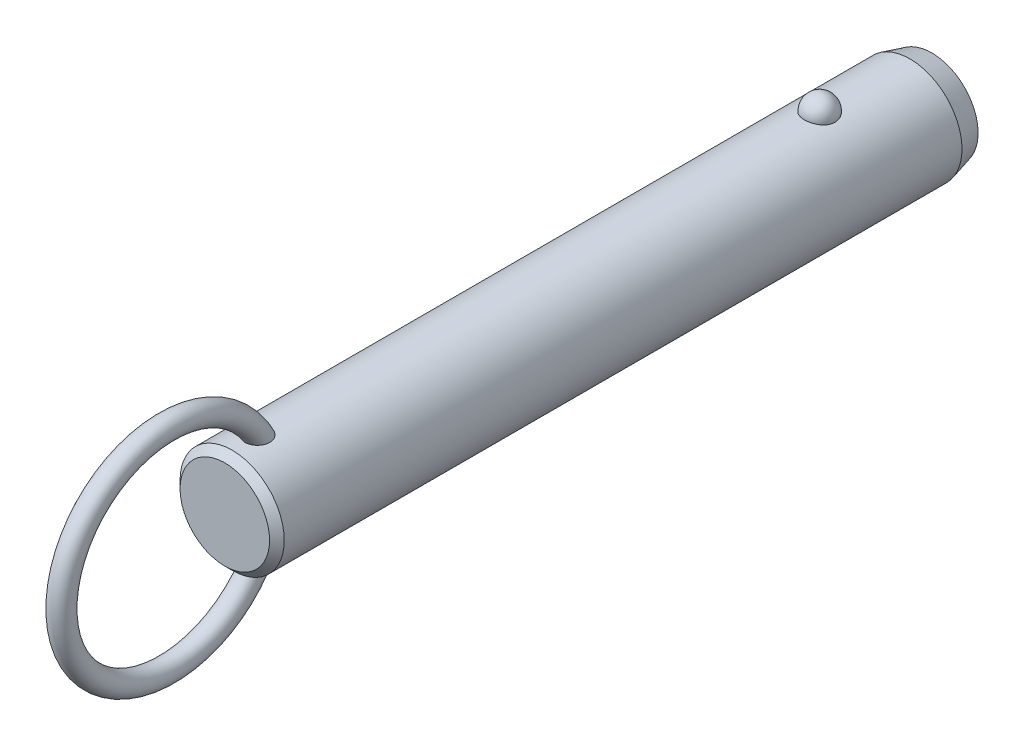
ISO-10303-21;
HEADER;
FILE_DESCRIPTION(('STEP AP214'),'2;1');
FILE_NAME('part.step','',(''),(''),'','','');
FILE_SCHEMA(('AUTOMOTIVE_DESIGN { 1 0 10303 214 1 1 1 1 }'));
ENDSEC;
DATA;
#1=APPLICATION_CONTEXT('core data for automotive mechanical design processes');
#2=APPLICATION_PROTOCOL_DEFINITION('international standard','automotive_design',2000,#1);
#3=PRODUCT_CONTEXT('',#1,'mechanical');
#4=PRODUCT('Part','Part','',(#3));
#5=PRODUCT_RELATED_PRODUCT_CATEGORY('part','',(#4));
#6=PRODUCT_DEFINITION_FORMATION('','',#4);
#7=PRODUCT_DEFINITION_CONTEXT('part definition',#1,'design');
#8=PRODUCT_DEFINITION('design','',#6,#7);
#9=PRODUCT_DEFINITION_SHAPE('','',#8);
#10=(LENGTH_UNIT() NAMED_UNIT(*) SI_UNIT(.MILLI.,.METRE.));
#11=(NAMED_UNIT(*) PLANE_ANGLE_UNIT() SI_UNIT($,.RADIAN.));
#12=(NAMED_UNIT(*) SI_UNIT($,.STERADIAN.) SOLID_ANGLE_UNIT());
#13=UNCERTAINTY_MEASURE_WITH_UNIT(LENGTH_MEASURE(1.E-05),#10,'distance_accuracy_value','');
#14=(GEOMETRIC_REPRESENTATION_CONTEXT(3) GLOBAL_UNCERTAINTY_ASSIGNED_CONTEXT((#13)) GLOBAL_UNIT_ASSIGNED_CONTEXT((#10,
#11,#12)) REPRESENTATION_CONTEXT('',''));
#15=CARTESIAN_POINT('',(0.,0.,0.));
#16=DIRECTION('',(0.,0.,1.));
#17=DIRECTION('',(1.,0.,0.));
#18=AXIS2_PLACEMENT_3D('',#15,#16,#17);
#19=CARTESIAN_POINT('',(0.,0.,71.1));
#20=DIRECTION('',(0.,0.,-1.));
#21=DIRECTION('',(-1.,0.,0.));
#22=AXIS2_PLACEMENT_3D('',#19,#20,#21);
#23=CYLINDRICAL_SURFACE('',#22,7.1);
#24=CARTESIAN_POINT('',(2.0769088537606,6.78943661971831,-2.1));
#25=CARTESIAN_POINT('',(2.07690739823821,6.78943796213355,-1.98268154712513));
#26=CARTESIAN_POINT('',(2.06738130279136,6.79237331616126,-1.86534506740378));
#27=CARTESIAN_POINT('',(2.0295040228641,6.8037853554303,-1.63400788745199));
#28=CARTESIAN_POINT('',(2.00114757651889,6.81226358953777,-1.52000812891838));
#29=CARTESIAN_POINT('',(1.92632025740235,6.83379798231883,-1.29863433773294));
#30=CARTESIAN_POINT('',(1.87985726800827,6.84685214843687,-1.19125744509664));
#31=CARTESIAN_POINT('',(1.76995205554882,6.87608091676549,-0.98604657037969));
#32=CARTESIAN_POINT('',(1.70650980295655,6.8922555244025,-0.88821260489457));
#33=CARTESIAN_POINT('',(1.5638119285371,6.92602930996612,-0.704242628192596));
#34=CARTESIAN_POINT('',(1.4844714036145,6.94363582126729,-0.618173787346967));
#35=CARTESIAN_POINT('',(1.31221746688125,6.97823658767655,-0.460740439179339));
#36=CARTESIAN_POINT('',(1.21930409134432,6.99523084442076,-0.389375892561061));
#37=CARTESIAN_POINT('',(1.02268781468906,7.02666176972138,-0.263547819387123));
#38=CARTESIAN_POINT('',(0.91902009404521,7.04110638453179,-0.209031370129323));
#39=CARTESIAN_POINT('',(0.703548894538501,7.06588726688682,-0.118163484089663));
#40=CARTESIAN_POINT('',(0.591746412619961,7.07622403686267,-0.0818098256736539));
#41=CARTESIAN_POINT('',(0.365557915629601,7.09147068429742,-0.0288711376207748));
#42=CARTESIAN_POINT('',(0.251267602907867,7.09648447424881,-0.0119070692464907));
#43=CARTESIAN_POINT('',(0.0213499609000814,7.10089837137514,0.00304925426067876));
#44=CARTESIAN_POINT('',(-0.0942772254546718,7.10029907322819,0.00104351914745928));
#45=CARTESIAN_POINT('',(-0.321651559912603,7.09360829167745,-0.0216931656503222));
#46=CARTESIAN_POINT('',(-0.433431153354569,7.08760388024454,-0.0421272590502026));
#47=CARTESIAN_POINT('',(-0.651862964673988,7.07086131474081,-0.100729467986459));
#48=CARTESIAN_POINT('',(-0.758515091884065,7.06012307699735,-0.138897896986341));
#49=CARTESIAN_POINT('',(-0.964449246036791,7.03496097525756,-0.232213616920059));
#50=CARTESIAN_POINT('',(-1.06368095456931,7.02051445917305,-0.287465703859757));
#51=CARTESIAN_POINT('',(-1.25145353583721,6.98948740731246,-0.413383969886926));
#52=CARTESIAN_POINT('',(-1.33999321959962,6.97290663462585,-0.48405186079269));
#53=CARTESIAN_POINT('',(-1.50591604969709,6.93898770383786,-0.640594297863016));
#54=CARTESIAN_POINT('',(-1.58302488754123,6.92164094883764,-0.726757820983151));
#55=CARTESIAN_POINT('',(-1.72189320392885,6.8884103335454,-0.91092752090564));
#56=CARTESIAN_POINT('',(-1.78365144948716,6.87252659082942,-1.008934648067));
#57=CARTESIAN_POINT('',(-1.89101272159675,6.84377189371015,-1.21549497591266));
#58=CARTESIAN_POINT('',(-1.93639553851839,6.83094274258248,-1.32416860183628));
#59=CARTESIAN_POINT('',(-2.00874275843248,6.81002070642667,-1.54791500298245));
#60=CARTESIAN_POINT('',(-2.03570774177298,6.80192767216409,-1.66298757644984));
#61=CARTESIAN_POINT('',(-2.07047276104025,6.7914266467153,-1.89571453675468));
#62=CARTESIAN_POINT('',(-2.07835878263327,6.78899315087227,-2.01335491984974));
#63=CARTESIAN_POINT('',(-2.07502083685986,6.79001409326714,-2.24833570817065));
#64=CARTESIAN_POINT('',(-2.06379746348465,6.7934683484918,-2.36567612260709));
#65=CARTESIAN_POINT('',(-2.02263913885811,6.80583442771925,-2.59603194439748));
#66=CARTESIAN_POINT('',(-1.99281127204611,6.81471501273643,-2.70906820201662));
#67=CARTESIAN_POINT('',(-1.91526639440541,6.83691232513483,-2.92836575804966));
#68=CARTESIAN_POINT('',(-1.8675486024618,6.85022924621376,-3.03462676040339));
#69=CARTESIAN_POINT('',(-1.75504492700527,6.87991336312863,-3.23806487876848));
#70=CARTESIAN_POINT('',(-1.69015924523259,6.89629822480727,-3.33518422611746));
#71=CARTESIAN_POINT('',(-1.54505404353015,6.93024852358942,-3.51697105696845));
#72=CARTESIAN_POINT('',(-1.46483385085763,6.94781401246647,-3.60163799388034));
#73=CARTESIAN_POINT('',(-1.29071406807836,6.98225977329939,-3.75654119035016));
#74=CARTESIAN_POINT('',(-1.19675650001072,6.99913673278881,-3.82671308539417));
#75=CARTESIAN_POINT('',(-0.997940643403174,7.03023618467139,-3.9501837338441));
#76=CARTESIAN_POINT('',(-0.89308318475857,7.04445887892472,-4.00348377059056));
#77=CARTESIAN_POINT('',(-0.676902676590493,7.06848365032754,-4.09107242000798));
#78=CARTESIAN_POINT('',(-0.565686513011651,7.0783430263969,-4.12560889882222));
#79=CARTESIAN_POINT('',(-0.338739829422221,7.09282534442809,-4.17575450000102));
#80=CARTESIAN_POINT('',(-0.223009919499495,7.09744899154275,-4.19136617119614));
#81=CARTESIAN_POINT('',(0.00707628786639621,7.10090930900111,-4.20307965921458));
#82=CARTESIAN_POINT('',(0.121410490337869,7.09986531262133,-4.19958377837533));
#83=CARTESIAN_POINT('',(0.347815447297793,7.092380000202,-4.17411564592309));
#84=CARTESIAN_POINT('',(0.459886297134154,7.08593891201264,-4.15214417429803));
#85=CARTESIAN_POINT('',(0.678084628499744,7.06838983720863,-4.09049562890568));
#86=CARTESIAN_POINT('',(0.784237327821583,7.05730369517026,-4.05090137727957));
#87=CARTESIAN_POINT('',(0.988305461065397,7.03163139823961,-3.95511447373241));
#88=CARTESIAN_POINT('',(1.08622031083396,7.01704499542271,-3.89892064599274));
#89=CARTESIAN_POINT('',(1.27284490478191,6.98562668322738,-3.77035541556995));
#90=CARTESIAN_POINT('',(1.36137372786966,6.96876135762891,-3.69772964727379));
#91=CARTESIAN_POINT('',(1.52509486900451,6.93477412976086,-3.53878279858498));
#92=CARTESIAN_POINT('',(1.60028496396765,6.91765218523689,-3.45245943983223));
#93=CARTESIAN_POINT('',(1.73681688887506,6.88465753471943,-3.26658774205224));
#94=CARTESIAN_POINT('',(1.79785966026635,6.86881574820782,-3.16681408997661));
#95=CARTESIAN_POINT('',(1.90265327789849,6.84053157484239,-2.95814408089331));
#96=CARTESIAN_POINT('',(1.94640861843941,6.82808830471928,-2.84925010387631));
#97=CARTESIAN_POINT('',(2.01274378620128,6.80881460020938,-2.63454318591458));
#98=CARTESIAN_POINT('',(2.03676193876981,6.80160856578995,-2.52920574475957));
#99=CARTESIAN_POINT('',(2.06884490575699,6.79191902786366,-2.3159172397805));
#100=CARTESIAN_POINT('',(2.07691019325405,6.78943538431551,-2.20796625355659));
#101=CARTESIAN_POINT('',(2.0769088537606,6.78943661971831,-2.1));
#102=B_SPLINE_CURVE_WITH_KNOTS('',3,(#24,#25,#26,#27,#28,#29,#30,#31,#32,#33,#34,#35,#36,#37,
#38,#39,#40,#41,#42,#43,#44,#45,#46,#47,#48,#49,#50,#51,#52,#53,#54,#55,#56,#57,#58,#59,#60,#61,
#62,#63,#64,#65,#66,#67,#68,#69,#70,#71,#72,#73,#74,#75,#76,#77,#78,#79,#80,#81,#82,#83,#84,#85,
#86,#87,#88,#89,#90,#91,#92,#93,#94,#95,#96,#97,#98,#99,#100,#101),.UNSPECIFIED.,.T.,.F.,(4,2,2,
2,2,2,2,2,2,2,2,2,2,2,2,2,2,2,2,2,2,2,2,2,2,2,2,2,2,2,2,2,2,2,2,2,2,2,4),(0.,0.351568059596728,
0.703234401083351,1.05474780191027,1.40626181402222,1.75970563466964,2.11314851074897,
2.4654696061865,2.81774759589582,3.16301449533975,3.50824481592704,3.84801136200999,
4.18778391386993,4.52968352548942,4.87162112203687,5.22076181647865,5.56993054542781,
5.92363364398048,6.27732559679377,6.62942052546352,6.98150450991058,7.33158042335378,
7.68167162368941,8.03384443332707,8.38603269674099,8.73975272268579,9.09344583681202,
9.44234545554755,9.79119807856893,10.1327344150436,10.4742563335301,10.8141898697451,
11.1541474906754,11.4997793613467,11.8454687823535,12.1979079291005,12.5502553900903,
12.8738073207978,13.1973496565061),.UNSPECIFIED.);
#103=CARTESIAN_POINT('',(2.0769088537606,6.78943661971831,-2.1));
#104=VERTEX_POINT('',#103);
#105=EDGE_CURVE('E41',#104,#104,#102,.T.);
#106=ORIENTED_EDGE('',*,*,#105,.T.);
#107=EDGE_LOOP('',(#106));
#108=FACE_BOUND('',#107,.T.);
#109=CARTESIAN_POINT('',(0.,0.,78.02));
#110=DIRECTION('',(0.,0.,1.));
#111=DIRECTION('',(1.,0.,0.));
#112=AXIS2_PLACEMENT_3D('',#109,#110,#111);
#113=CIRCLE('',#112,7.1);
#114=CARTESIAN_POINT('',(7.1,0.,78.02));
#115=VERTEX_POINT('',#114);
#116=EDGE_CURVE('E10',#115,#115,#113,.F.);
#117=ORIENTED_EDGE('',*,*,#116,.T.);
#118=EDGE_LOOP('',(#117));
#119=FACE_BOUND('',#118,.T.);
#120=CARTESIAN_POINT('',(-0.429539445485,-7.08699541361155,72.8429212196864));
#121=CARTESIAN_POINT('',(-0.508331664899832,-7.08221999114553,72.8668764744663));
#122=CARTESIAN_POINT('',(-0.58503984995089,-7.07624016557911,72.8974570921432));
#123=CARTESIAN_POINT('',(-0.732082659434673,-7.06254296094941,72.9710242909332));
#124=CARTESIAN_POINT('',(-0.802417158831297,-7.05482554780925,73.0140111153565));
#125=CARTESIAN_POINT('',(-0.934722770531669,-7.03851844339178,73.1111135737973));
#126=CARTESIAN_POINT('',(-0.99670020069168,-7.02992941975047,73.1652207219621));
#127=CARTESIAN_POINT('',(-1.11079942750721,-7.01280697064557,73.2829676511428));
#128=CARTESIAN_POINT('',(-1.16292136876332,-7.00427354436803,73.3466072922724));
#129=CARTESIAN_POINT('',(-1.25705660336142,-6.98799959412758,73.4826870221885));
#130=CARTESIAN_POINT('',(-1.29888032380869,-6.98027525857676,73.5552598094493));
#131=CARTESIAN_POINT('',(-1.37069920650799,-6.96652886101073,73.7061686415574));
#132=CARTESIAN_POINT('',(-1.40069157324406,-6.96050720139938,73.7845060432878));
#133=CARTESIAN_POINT('',(-1.45043507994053,-6.95031881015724,73.9501903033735));
#134=CARTESIAN_POINT('',(-1.46937115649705,-6.94630231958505,74.0377897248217));
#135=CARTESIAN_POINT('',(-1.49424917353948,-6.94099239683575,74.2148714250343));
#136=CARTESIAN_POINT('',(-1.50018601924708,-6.93970003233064,74.3043544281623));
#137=CARTESIAN_POINT('',(-1.49978214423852,-6.93978815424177,74.4940607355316));
#138=CARTESIAN_POINT('',(-1.49187639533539,-6.94150934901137,74.594279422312));
#139=CARTESIAN_POINT('',(-1.46177925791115,-6.94790814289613,74.7924798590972));
#140=CARTESIAN_POINT('',(-1.43957541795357,-6.95258831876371,74.890459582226));
#141=CARTESIAN_POINT('',(-1.37783293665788,-6.96510647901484,75.0953629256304));
#142=CARTESIAN_POINT('',(-1.33634073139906,-6.97328848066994,75.2016801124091));
#143=CARTESIAN_POINT('',(-1.23686994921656,-6.99161706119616,75.4061777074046));
#144=CARTESIAN_POINT('',(-1.17889192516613,-7.00176357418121,75.5043583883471));
#145=CARTESIAN_POINT('',(-1.0587512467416,-7.02082898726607,75.6723743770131));
#146=CARTESIAN_POINT('',(-0.999247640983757,-7.02963746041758,75.7441230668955));
#147=CARTESIAN_POINT('',(-0.869494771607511,-7.04686074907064,75.8771959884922));
#148=CARTESIAN_POINT('',(-0.799263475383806,-7.05527619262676,75.9385372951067));
#149=CARTESIAN_POINT('',(-0.665408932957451,-7.06899457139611,76.0351316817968));
#150=CARTESIAN_POINT('',(-0.603817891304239,-7.07457275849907,76.0731512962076));
#151=CARTESIAN_POINT('',(-0.475172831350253,-7.08437420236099,76.1387581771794));
#152=CARTESIAN_POINT('',(-0.408123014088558,-7.08859848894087,76.1663533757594));
#153=CARTESIAN_POINT('',(-0.269431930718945,-7.09522749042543,76.2092569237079));
#154=CARTESIAN_POINT('',(-0.197757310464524,-7.09761688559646,76.2244618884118));
#155=CARTESIAN_POINT('',(-0.0527849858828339,-7.10017268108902,76.2407168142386));
#156=CARTESIAN_POINT('',(0.0205115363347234,-7.10034065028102,76.2417767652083));
#157=CARTESIAN_POINT('',(0.156426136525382,-7.09855986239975,76.2304619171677));
#158=CARTESIAN_POINT('',(0.219199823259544,-7.09688191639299,76.2198060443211));
#159=CARTESIAN_POINT('',(0.342134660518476,-7.09201880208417,76.1885379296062));
#160=CARTESIAN_POINT('',(0.402295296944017,-7.08883333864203,76.1679237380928));
#161=CARTESIAN_POINT('',(0.520687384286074,-7.08113868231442,76.1172125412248));
#162=CARTESIAN_POINT('',(0.578791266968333,-7.07658958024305,76.0868272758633));
#163=CARTESIAN_POINT('',(0.690173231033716,-7.06659708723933,76.0183678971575));
#164=CARTESIAN_POINT('',(0.743447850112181,-7.061153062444,75.9802883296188));
#165=CARTESIAN_POINT('',(0.870947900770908,-7.04680292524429,75.8765929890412));
#166=CARTESIAN_POINT('',(0.941828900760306,-7.0375580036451,75.8068972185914));
#167=CARTESIAN_POINT('',(1.07136606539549,-7.01900793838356,75.6569450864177));
#168=CARTESIAN_POINT('',(1.13000013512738,-7.00970271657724,75.5766700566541));
#169=CARTESIAN_POINT('',(1.23579584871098,-6.99183327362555,75.4068997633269));
#170=CARTESIAN_POINT('',(1.2827427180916,-6.98328455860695,75.3172696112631));
#171=CARTESIAN_POINT('',(1.36351442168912,-6.96796352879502,75.1321763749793));
#172=CARTESIAN_POINT('',(1.39733971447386,-6.96119115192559,75.0367134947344));
#173=CARTESIAN_POINT('',(1.45579181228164,-6.94922464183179,74.8253092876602));
#174=CARTESIAN_POINT('',(1.47790145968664,-6.94449000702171,74.708631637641));
#175=CARTESIAN_POINT('',(1.50168752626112,-6.93938731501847,74.4730153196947));
#176=CARTESIAN_POINT('',(1.50336085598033,-6.93901991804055,74.3540763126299));
#177=CARTESIAN_POINT('',(1.48486516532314,-6.9430010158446,74.1236079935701));
#178=CARTESIAN_POINT('',(1.46573441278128,-6.9471253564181,74.011995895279));
#179=CARTESIAN_POINT('',(1.40606892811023,-6.95944667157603,73.7948868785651));
#180=CARTESIAN_POINT('',(1.36556446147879,-6.96763788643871,73.6893815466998));
#181=CARTESIAN_POINT('',(1.27082700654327,-6.98548038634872,73.5042879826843));
#182=CARTESIAN_POINT('',(1.21949810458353,-6.99473841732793,73.4231719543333));
#183=CARTESIAN_POINT('',(1.10242050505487,-7.01414069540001,73.2722278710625));
#184=CARTESIAN_POINT('',(1.03668119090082,-7.02428436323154,73.2023925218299));
#185=CARTESIAN_POINT('',(0.900559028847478,-7.04295285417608,73.0835735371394));
#186=CARTESIAN_POINT('',(0.83142884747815,-7.05153466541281,73.0331573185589));
#187=CARTESIAN_POINT('',(0.68529187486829,-7.06723150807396,72.9451429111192));
#188=CARTESIAN_POINT('',(0.608287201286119,-7.0743469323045,72.9075412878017));
#189=CARTESIAN_POINT('',(0.451878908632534,-7.08602232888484,72.8474915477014));
#190=CARTESIAN_POINT('',(0.372686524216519,-7.09067127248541,72.8245088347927));
#191=CARTESIAN_POINT('',(0.211477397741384,-7.09730788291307,72.7920357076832));
#192=CARTESIAN_POINT('',(0.129460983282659,-7.09929585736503,72.7825437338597));
#193=CARTESIAN_POINT('',(-0.0332905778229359,-7.10037858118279,72.7773517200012));
#194=CARTESIAN_POINT('',(-0.114016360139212,-7.09953334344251,72.7813656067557));
#195=CARTESIAN_POINT('',(-0.273670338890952,-7.09517338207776,72.8024540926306));
#196=CARTESIAN_POINT('',(-0.352598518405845,-7.09165863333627,72.8195288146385));
#197=CARTESIAN_POINT('',(-0.429539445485,-7.08699541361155,72.8429212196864));
#198=B_SPLINE_CURVE_WITH_KNOTS('',3,(#120,#121,#122,#123,#124,#125,#126,#127,#128,#129,#130,
#131,#132,#133,#134,#135,#136,#137,#138,#139,#140,#141,#142,#143,#144,#145,#146,#147,#148,#149,
#150,#151,#152,#153,#154,#155,#156,#157,#158,#159,#160,#161,#162,#163,#164,#165,#166,#167,#168,
#169,#170,#171,#172,#173,#174,#175,#176,#177,#178,#179,#180,#181,#182,#183,#184,#185,#186,#187,
#188,#189,#190,#191,#192,#193,#194,#195,#196,#197),.UNSPECIFIED.,.T.,.F.,(4,2,2,2,2,2,2,2,2,2,2,
2,2,2,2,2,2,2,2,2,2,2,2,2,2,2,2,2,2,2,2,2,2,2,2,2,2,2,4),(0.,0.247183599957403,
0.494372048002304,0.741372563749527,0.988369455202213,1.23962059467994,1.49093106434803,
1.75897818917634,2.02713035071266,2.3275826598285,2.62829697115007,2.97008736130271,
3.31186629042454,3.59175319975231,3.87117637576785,4.08813841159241,4.30493502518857,
4.52352259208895,4.74195577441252,4.9321532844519,5.12238804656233,5.31884850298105,
5.51544871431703,5.81332317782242,6.11173048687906,6.4152726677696,6.71880423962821,
7.07358156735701,7.42841252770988,7.76631485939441,8.10373999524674,8.3914224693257,
8.67891817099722,8.93560332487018,9.19221962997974,9.43881106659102,9.68537399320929,
9.92674752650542,10.1681233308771),.UNSPECIFIED.);
#199=CARTESIAN_POINT('',(-0.429539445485,-7.08699541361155,72.8429212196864));
#200=VERTEX_POINT('',#199);
#201=EDGE_CURVE('E60',#200,#200,#198,.T.);
#202=ORIENTED_EDGE('',*,*,#201,.T.);
#203=EDGE_LOOP('',(#202));
#204=FACE_BOUND('',#203,.T.);
#205=CARTESIAN_POINT('',(-0.429539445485,7.08699541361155,72.8429212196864));
#206=CARTESIAN_POINT('',(-0.351665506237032,7.09171429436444,72.8192469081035));
#207=CARTESIAN_POINT('',(-0.271733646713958,7.09525896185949,72.8020369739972));
#208=CARTESIAN_POINT('',(-0.110026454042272,7.09960839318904,72.7810059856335));
#209=CARTESIAN_POINT('',(-0.0282502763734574,7.10041187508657,72.777191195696));
#210=CARTESIAN_POINT('',(0.134782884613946,7.09918849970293,72.783059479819));
#211=CARTESIAN_POINT('',(0.216039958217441,7.09716214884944,72.7927401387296));
#212=CARTESIAN_POINT('',(0.375730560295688,7.09050177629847,72.8253471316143));
#213=CARTESIAN_POINT('',(0.454164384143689,7.08586802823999,72.8482720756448));
#214=CARTESIAN_POINT('',(0.606025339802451,7.07449911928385,72.906771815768));
#215=CARTESIAN_POINT('',(0.679451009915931,7.06776334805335,72.9423502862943));
#216=CARTESIAN_POINT('',(0.819234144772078,7.05292866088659,73.0251753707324));
#217=CARTESIAN_POINT('',(0.885591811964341,7.04482978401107,73.0724216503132));
#218=CARTESIAN_POINT('',(1.00993211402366,7.02808709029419,73.1775902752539));
#219=CARTESIAN_POINT('',(1.06785399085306,7.01943990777,73.235583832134));
#220=CARTESIAN_POINT('',(1.17342527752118,7.00256662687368,73.3603013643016));
#221=CARTESIAN_POINT('',(1.22107408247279,6.99434055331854,73.4270258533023));
#222=CARTESIAN_POINT('',(1.30652927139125,6.97889183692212,73.5693622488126));
#223=CARTESIAN_POINT('',(1.34399711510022,6.97170674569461,73.6451808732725));
#224=CARTESIAN_POINT('',(1.40682616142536,6.95930080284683,73.8018100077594));
#225=CARTESIAN_POINT('',(1.43218374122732,6.95408053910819,73.8826220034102));
#226=CARTESIAN_POINT('',(1.47246409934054,6.94566853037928,74.0535314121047));
#227=CARTESIAN_POINT('',(1.48642590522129,6.9426653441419,74.1438630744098));
#228=CARTESIAN_POINT('',(1.5011410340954,6.93949744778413,74.325619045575));
#229=CARTESIAN_POINT('',(1.50188917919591,6.93933385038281,74.4170437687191));
#230=CARTESIAN_POINT('',(1.49030464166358,6.94183245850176,74.6108438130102));
#231=CARTESIAN_POINT('',(1.47627413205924,6.94486147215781,74.713112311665));
#232=CARTESIAN_POINT('',(1.43356351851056,6.95380194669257,74.9144719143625));
#233=CARTESIAN_POINT('',(1.4048676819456,6.95971650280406,75.0135594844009));
#234=CARTESIAN_POINT('',(1.32908750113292,6.97461208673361,75.2189087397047));
#235=CARTESIAN_POINT('',(1.28011435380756,6.98388945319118,75.3244566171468));
#236=CARTESIAN_POINT('',(1.16520357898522,7.00397743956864,75.5257604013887));
#237=CARTESIAN_POINT('',(1.09927694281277,7.01478706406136,75.6215225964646));
#238=CARTESIAN_POINT('',(0.969361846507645,7.03373936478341,75.7767565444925));
#239=CARTESIAN_POINT('',(0.909042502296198,7.04187023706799,75.8393032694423));
#240=CARTESIAN_POINT('',(0.77917855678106,7.0574173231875,75.9540535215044));
#241=CARTESIAN_POINT('',(0.70964977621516,7.06483472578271,76.0062744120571));
#242=CARTESIAN_POINT('',(0.576854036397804,7.0767751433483,76.0881138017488));
#243=CARTESIAN_POINT('',(0.515118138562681,7.08158033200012,76.1201641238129));
#244=CARTESIAN_POINT('',(0.387127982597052,7.08972701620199,76.1737656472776));
#245=CARTESIAN_POINT('',(0.320877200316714,7.09306962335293,76.1953248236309));
#246=CARTESIAN_POINT('',(0.185041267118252,7.09791507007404,76.2264005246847));
#247=CARTESIAN_POINT('',(0.115437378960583,7.09940591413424,76.2358385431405));
#248=CARTESIAN_POINT('',(-0.0243157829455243,7.10030171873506,76.2415226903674));
#249=CARTESIAN_POINT('',(-0.0944648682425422,7.0997073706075,76.2377731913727));
#250=CARTESIAN_POINT('',(-0.225713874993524,7.09668414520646,76.2185081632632));
#251=CARTESIAN_POINT('',(-0.287006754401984,7.09444865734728,76.2042323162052));
#252=CARTESIAN_POINT('',(-0.40655537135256,7.08860360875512,76.1663685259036));
#253=CARTESIAN_POINT('',(-0.46480981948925,7.08499346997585,76.1427766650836));
#254=CARTESIAN_POINT('',(-0.594955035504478,7.07541654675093,76.0789232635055));
#255=CARTESIAN_POINT('',(-0.665389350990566,7.06906574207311,76.035753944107));
#256=CARTESIAN_POINT('',(-0.798242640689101,7.05530261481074,75.938587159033));
#257=CARTESIAN_POINT('',(-0.860645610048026,7.0478882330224,75.8845686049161));
#258=CARTESIAN_POINT('',(-0.994249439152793,7.03045217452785,75.7509965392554));
#259=CARTESIAN_POINT('',(-1.06260129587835,7.02030745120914,75.6686143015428));
#260=CARTESIAN_POINT('',(-1.18502045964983,7.00068382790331,75.4938439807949));
#261=CARTESIAN_POINT('',(-1.23907684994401,6.99120544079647,75.401448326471));
#262=CARTESIAN_POINT('',(-1.33335589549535,6.97384343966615,75.2080085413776));
#263=CARTESIAN_POINT('',(-1.37336138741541,6.96598557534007,75.1068564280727));
#264=CARTESIAN_POINT('',(-1.43770677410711,6.9529905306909,74.8995046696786));
#265=CARTESIAN_POINT('',(-1.46204473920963,6.94785368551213,74.79330440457));
#266=CARTESIAN_POINT('',(-1.49537533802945,6.94076296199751,74.5682317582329));
#267=CARTESIAN_POINT('',(-1.50273564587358,6.93914842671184,74.4490975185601));
#268=CARTESIAN_POINT('',(-1.4954555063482,6.94072368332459,74.2114703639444));
#269=CARTESIAN_POINT('',(-1.48082914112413,6.94391040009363,74.0929770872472));
#270=CARTESIAN_POINT('',(-1.43076401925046,6.95438579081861,73.8734325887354));
#271=CARTESIAN_POINT('',(-1.39762227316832,6.96121852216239,73.7718413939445));
#272=CARTESIAN_POINT('',(-1.31211274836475,6.97783941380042,73.5773513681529));
#273=CARTESIAN_POINT('',(-1.2597660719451,6.98762432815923,73.4844431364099));
#274=CARTESIAN_POINT('',(-1.14583073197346,7.00713153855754,73.3241601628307));
#275=CARTESIAN_POINT('',(-1.0866594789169,7.01665982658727,73.2550351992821));
#276=CARTESIAN_POINT('',(-0.956606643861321,7.03556646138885,73.1288786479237));
#277=CARTESIAN_POINT('',(-0.88573712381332,7.04494495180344,73.0718347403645));
#278=CARTESIAN_POINT('',(-0.75155804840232,7.06035735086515,72.9831004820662));
#279=CARTESIAN_POINT('',(-0.690120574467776,7.0666695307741,72.9485932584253));
#280=CARTESIAN_POINT('',(-0.562815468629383,7.07794609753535,72.8887507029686));
#281=CARTESIAN_POINT('',(-0.496948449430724,7.08291067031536,72.8634141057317));
#282=CARTESIAN_POINT('',(-0.429539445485,7.08699541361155,72.8429212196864));
#283=B_SPLINE_CURVE_WITH_KNOTS('',3,(#205,#206,#207,#208,#209,#210,#211,#212,#213,#214,#215,
#216,#217,#218,#219,#220,#221,#222,#223,#224,#225,#226,#227,#228,#229,#230,#231,#232,#233,#234,
#235,#236,#237,#238,#239,#240,#241,#242,#243,#244,#245,#246,#247,#248,#249,#250,#251,#252,#253,
#254,#255,#256,#257,#258,#259,#260,#261,#262,#263,#264,#265,#266,#267,#268,#269,#270,#271,#272,
#273,#274,#275,#276,#277,#278,#279,#280,#281,#282),.UNSPECIFIED.,.T.,.F.,(4,2,2,2,2,2,2,2,2,2,2,
2,2,2,2,2,2,2,2,2,2,2,2,2,2,2,2,2,2,2,2,2,2,2,2,2,2,2,4),(0.,0.244335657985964,
0.488785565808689,0.73319173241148,0.977572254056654,1.22202379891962,1.46646834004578,
1.71259457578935,1.95873529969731,2.21226768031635,2.46587585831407,2.73913816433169,
3.01250754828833,3.32109936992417,3.63002293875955,3.97863512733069,4.32702187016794,
4.5879394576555,4.84841449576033,5.05676704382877,5.26496096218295,5.47449661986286,
5.68396281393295,5.8720544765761,6.06022532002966,6.30743751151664,6.55513496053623,
6.87602468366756,7.19715875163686,7.52305774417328,7.84899686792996,8.20516155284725,
8.56109821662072,8.88040084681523,9.19935367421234,9.47236282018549,9.74509220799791,
9.9566225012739,10.1681235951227),.UNSPECIFIED.);
#284=CARTESIAN_POINT('',(-0.429539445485,7.08699541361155,72.8429212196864));
#285=VERTEX_POINT('',#284);
#286=EDGE_CURVE('E68',#285,#285,#283,.T.);
#287=ORIENTED_EDGE('',*,*,#286,.T.);
#288=EDGE_LOOP('',(#287));
#289=FACE_BOUND('',#288,.T.);
#290=CARTESIAN_POINT('',(0.,0.,-14.3999999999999));
#291=DIRECTION('',(0.,0.,-1.));
#292=DIRECTION('',(-1.,0.,0.));
#293=AXIS2_PLACEMENT_3D('',#290,#291,#292);
#294=CIRCLE('',#293,7.1);
#295=CARTESIAN_POINT('',(-7.1,0.,-14.3999999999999));
#296=VERTEX_POINT('',#295);
#297=EDGE_CURVE('E57',#296,#296,#294,.F.);
#298=ORIENTED_EDGE('',*,*,#297,.T.);
#299=EDGE_LOOP('',(#298));
#300=FACE_BOUND('',#299,.T.);
#301=ADVANCED_FACE('F37',(#108,#119,#204,#289,#300),#23,.T.);
#302=CARTESIAN_POINT('',(0.,0.,-17.4));
#303=DIRECTION('',(0.,0.,-1.));
#304=DIRECTION('',(-1.,0.,0.));
#305=AXIS2_PLACEMENT_3D('',#302,#303,#304);
#306=PLANE('',#305);
#307=CARTESIAN_POINT('',(0.,0.,-17.4));
#308=DIRECTION('',(0.,0.,-1.));
#309=DIRECTION('',(-1.,0.,0.));
#310=AXIS2_PLACEMENT_3D('',#307,#308,#309);
#311=CIRCLE('',#310,6.29615242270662);
#312=CARTESIAN_POINT('',(-6.29615242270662,0.,-17.4));
#313=VERTEX_POINT('',#312);
#314=EDGE_CURVE('E67',#313,#313,#311,.T.);
#315=ORIENTED_EDGE('',*,*,#314,.T.);
#316=EDGE_LOOP('',(#315));
#317=FACE_BOUND('',#316,.T.);
#318=ADVANCED_FACE('F86',(#317),#306,.T.);
#319=CARTESIAN_POINT('',(0.,0.,-17.4));
#320=DIRECTION('',(0.,0.,1.));
#321=DIRECTION('',(1.,0.,0.));
#322=AXIS2_PLACEMENT_3D('',#319,#320,#321);
#323=CONICAL_SURFACE('',#322,6.29615242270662,0.261799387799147);
#324=ORIENTED_EDGE('',*,*,#297,.F.);
#325=EDGE_LOOP('',(#324));
#326=FACE_BOUND('',#325,.T.);
#327=ORIENTED_EDGE('',*,*,#314,.F.);
#328=EDGE_LOOP('',(#327));
#329=FACE_BOUND('',#328,.T.);
#330=ADVANCED_FACE('F84',(#326,#329),#323,.T.);
#331=CARTESIAN_POINT('',(0.,0.,79.02));
#332=DIRECTION('',(0.,0.,1.));
#333=DIRECTION('',(1.,0.,0.));
#334=AXIS2_PLACEMENT_3D('',#331,#332,#333);
#335=PLANE('',#334);
#336=CARTESIAN_POINT('',(0.,0.,79.02));
#337=DIRECTION('',(0.,0.,1.));
#338=DIRECTION('',(1.,0.,0.));
#339=AXIS2_PLACEMENT_3D('',#336,#337,#338);
#340=CIRCLE('',#339,6.09999999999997);
#341=CARTESIAN_POINT('',(6.09999999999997,0.,79.02));
#342=VERTEX_POINT('',#341);
#343=EDGE_CURVE('E50',#342,#342,#340,.T.);
#344=ORIENTED_EDGE('',*,*,#343,.T.);
#345=EDGE_LOOP('',(#344));
#346=FACE_BOUND('',#345,.T.);
#347=ADVANCED_FACE('F78',(#346),#335,.T.);
#348=CARTESIAN_POINT('',(0.,0.,86.95));
#349=DIRECTION('',(1.,0.,0.));
#350=DIRECTION('',(0.,0.,-1.));
#351=AXIS2_PLACEMENT_3D('',#348,#349,#350);
#352=TOROIDAL_SURFACE('',#351,14.35,1.5);
#353=ORIENTED_EDGE('',*,*,#286,.F.);
#354=EDGE_LOOP('',(#353));
#355=FACE_BOUND('',#354,.T.);
#356=ORIENTED_EDGE('',*,*,#201,.F.);
#357=EDGE_LOOP('',(#356));
#358=FACE_BOUND('',#357,.T.);
#359=ADVANCED_FACE('F74',(#355,#358),#352,.T.);
#360=CARTESIAN_POINT('',(0.,0.,79.02));
#361=DIRECTION('',(0.,0.,-1.));
#362=DIRECTION('',(-1.,0.,0.));
#363=AXIS2_PLACEMENT_3D('',#360,#361,#362);
#364=CONICAL_SURFACE('',#363,6.09999999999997,0.78539816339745);
#365=ORIENTED_EDGE('',*,*,#116,.F.);
#366=EDGE_LOOP('',(#365));
#367=FACE_BOUND('',#366,.T.);
#368=ORIENTED_EDGE('',*,*,#343,.F.);
#369=EDGE_LOOP('',(#368));
#370=FACE_BOUND('',#369,.T.);
#371=ADVANCED_FACE('F39',(#367,#370),#364,.T.);
#372=CARTESIAN_POINT('',(0.,7.1,-2.1));
#373=DIRECTION('',(0.,1.,0.));
#374=DIRECTION('',(0.,0.,1.));
#375=AXIS2_PLACEMENT_3D('',#372,#373,#374);
#376=SPHERICAL_SURFACE('',#375,2.10000000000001);
#377=ORIENTED_EDGE('',*,*,#105,.F.);
#378=EDGE_LOOP('',(#377));
#379=FACE_BOUND('',#378,.T.);
#380=ADVANCED_FACE('F80',(#379),#376,.T.);
#381=CLOSED_SHELL('',(#301,#318,#330,#347,#359,#371,#380));
#382=MANIFOLD_SOLID_BREP('B2',#381);
#383=ADVANCED_BREP_SHAPE_REPRESENTATION('',(#18,#382),#14);
#384=SHAPE_DEFINITION_REPRESENTATION(#9,#383);
ENDSEC;
END-ISO-10303-21;
